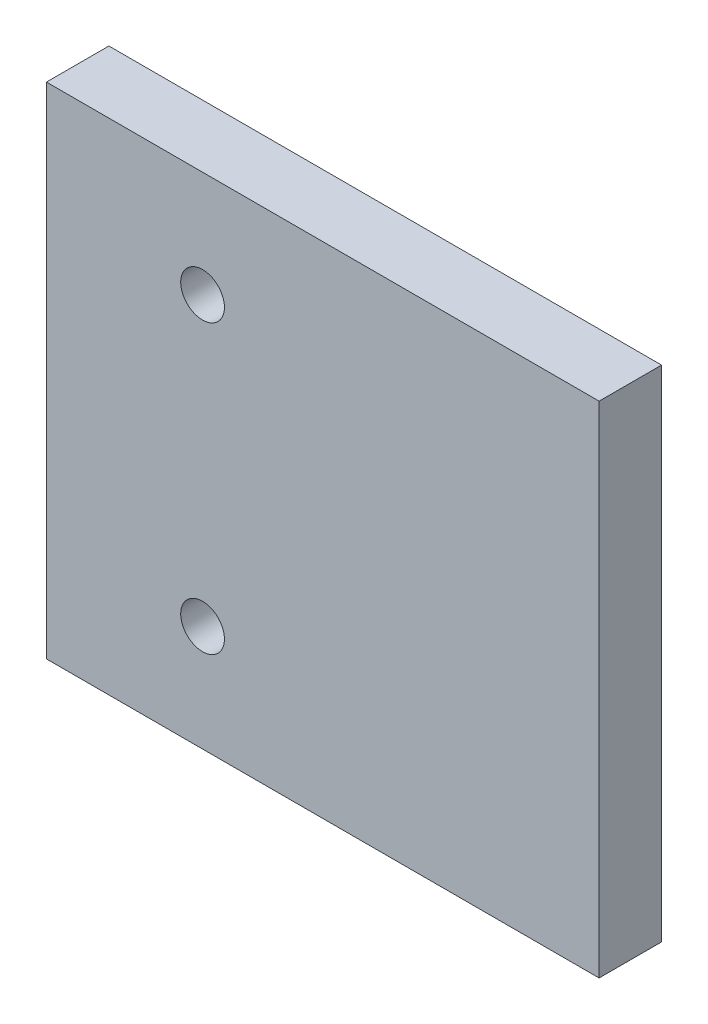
ISO-10303-21;
HEADER;
FILE_DESCRIPTION(('STEP AP214'),'2;1');
FILE_NAME('part.step','',(''),(''),'','','');
FILE_SCHEMA(('AUTOMOTIVE_DESIGN { 1 0 10303 214 1 1 1 1 }'));
ENDSEC;
DATA;
#1=APPLICATION_CONTEXT('core data for automotive mechanical design processes');
#2=APPLICATION_PROTOCOL_DEFINITION('international standard','automotive_design',2000,#1);
#3=PRODUCT_CONTEXT('',#1,'mechanical');
#4=PRODUCT('Part','Part','',(#3));
#5=PRODUCT_RELATED_PRODUCT_CATEGORY('part','',(#4));
#6=PRODUCT_DEFINITION_FORMATION('','',#4);
#7=PRODUCT_DEFINITION_CONTEXT('part definition',#1,'design');
#8=PRODUCT_DEFINITION('design','',#6,#7);
#9=PRODUCT_DEFINITION_SHAPE('','',#8);
#10=(LENGTH_UNIT() NAMED_UNIT(*) SI_UNIT(.MILLI.,.METRE.));
#11=(NAMED_UNIT(*) PLANE_ANGLE_UNIT() SI_UNIT($,.RADIAN.));
#12=(NAMED_UNIT(*) SI_UNIT($,.STERADIAN.) SOLID_ANGLE_UNIT());
#13=UNCERTAINTY_MEASURE_WITH_UNIT(LENGTH_MEASURE(1.E-05),#10,'distance_accuracy_value','');
#14=(GEOMETRIC_REPRESENTATION_CONTEXT(3) GLOBAL_UNCERTAINTY_ASSIGNED_CONTEXT((#13)) GLOBAL_UNIT_ASSIGNED_CONTEXT((#10,
#11,#12)) REPRESENTATION_CONTEXT('',''));
#15=CARTESIAN_POINT('',(0.,0.,0.));
#16=DIRECTION('',(0.,0.,1.));
#17=DIRECTION('',(1.,0.,0.));
#18=AXIS2_PLACEMENT_3D('',#15,#16,#17);
#19=CARTESIAN_POINT('',(0.,80.,10.));
#20=DIRECTION('',(0.,0.,-1.));
#21=DIRECTION('',(-1.,0.,0.));
#22=AXIS2_PLACEMENT_3D('',#19,#20,#21);
#23=PLANE('',#22);
#24=CARTESIAN_POINT('',(25.,63.,10.));
#25=DIRECTION('',(0.,0.,1.));
#26=DIRECTION('',(1.,0.,0.));
#27=AXIS2_PLACEMENT_3D('',#24,#25,#26);
#28=CIRCLE('',#27,3.5);
#29=CARTESIAN_POINT('',(28.5,63.,10.));
#30=VERTEX_POINT('',#29);
#31=EDGE_CURVE('E91',#30,#30,#28,.T.);
#32=ORIENTED_EDGE('',*,*,#31,.F.);
#33=EDGE_LOOP('',(#32));
#34=FACE_BOUND('',#33,.T.);
#35=DIRECTION('',(0.,-1.,0.));
#36=VECTOR('',#35,1.);
#37=CARTESIAN_POINT('',(0.,0.,10.));
#38=LINE('',#37,#36);
#39=CARTESIAN_POINT('',(0.,80.,10.));
#40=VERTEX_POINT('',#39);
#41=CARTESIAN_POINT('',(0.,0.,10.));
#42=VERTEX_POINT('',#41);
#43=EDGE_CURVE('E101',#40,#42,#38,.T.);
#44=ORIENTED_EDGE('',*,*,#43,.T.);
#45=DIRECTION('',(1.,0.,0.));
#46=VECTOR('',#45,1.);
#47=CARTESIAN_POINT('',(0.,0.,10.));
#48=LINE('',#47,#46);
#49=CARTESIAN_POINT('',(88.5,0.,10.));
#50=VERTEX_POINT('',#49);
#51=EDGE_CURVE('E86',#42,#50,#48,.T.);
#52=ORIENTED_EDGE('',*,*,#51,.T.);
#53=DIRECTION('',(0.,1.,0.));
#54=VECTOR('',#53,1.);
#55=CARTESIAN_POINT('',(88.5,0.,10.));
#56=LINE('',#55,#54);
#57=CARTESIAN_POINT('',(88.5,80.,10.));
#58=VERTEX_POINT('',#57);
#59=EDGE_CURVE('E52',#50,#58,#56,.T.);
#60=ORIENTED_EDGE('',*,*,#59,.T.);
#61=DIRECTION('',(-1.,0.,0.));
#62=VECTOR('',#61,1.);
#63=CARTESIAN_POINT('',(0.,80.,10.));
#64=LINE('',#63,#62);
#65=EDGE_CURVE('E47',#58,#40,#64,.T.);
#66=ORIENTED_EDGE('',*,*,#65,.T.);
#67=EDGE_LOOP('',(#44,#52,#60,#66));
#68=FACE_BOUND('',#67,.T.);
#69=CARTESIAN_POINT('',(25.,17.,10.));
#70=DIRECTION('',(0.,0.,1.));
#71=DIRECTION('',(1.,0.,0.));
#72=AXIS2_PLACEMENT_3D('',#69,#70,#71);
#73=CIRCLE('',#72,3.5);
#74=CARTESIAN_POINT('',(28.5,17.,10.));
#75=VERTEX_POINT('',#74);
#76=EDGE_CURVE('E119',#75,#75,#73,.T.);
#77=ORIENTED_EDGE('',*,*,#76,.F.);
#78=EDGE_LOOP('',(#77));
#79=FACE_BOUND('',#78,.T.);
#80=ADVANCED_FACE('F32',(#34,#68,#79),#23,.F.);
#81=CARTESIAN_POINT('',(0.,80.,0.));
#82=DIRECTION('',(0.,0.,-1.));
#83=DIRECTION('',(-1.,0.,0.));
#84=AXIS2_PLACEMENT_3D('',#81,#82,#83);
#85=PLANE('',#84);
#86=CARTESIAN_POINT('',(25.,63.,0.));
#87=DIRECTION('',(0.,0.,1.));
#88=DIRECTION('',(1.,0.,0.));
#89=AXIS2_PLACEMENT_3D('',#86,#87,#88);
#90=CIRCLE('',#89,3.5);
#91=CARTESIAN_POINT('',(28.5,63.,0.));
#92=VERTEX_POINT('',#91);
#93=EDGE_CURVE('E94',#92,#92,#90,.T.);
#94=ORIENTED_EDGE('',*,*,#93,.T.);
#95=EDGE_LOOP('',(#94));
#96=FACE_BOUND('',#95,.T.);
#97=DIRECTION('',(0.,-1.,0.));
#98=VECTOR('',#97,1.);
#99=CARTESIAN_POINT('',(0.,0.,0.));
#100=LINE('',#99,#98);
#101=CARTESIAN_POINT('',(0.,80.,0.));
#102=VERTEX_POINT('',#101);
#103=CARTESIAN_POINT('',(0.,0.,0.));
#104=VERTEX_POINT('',#103);
#105=EDGE_CURVE('E78',#102,#104,#100,.T.);
#106=ORIENTED_EDGE('',*,*,#105,.F.);
#107=DIRECTION('',(-1.,0.,0.));
#108=VECTOR('',#107,1.);
#109=CARTESIAN_POINT('',(0.,80.,0.));
#110=LINE('',#109,#108);
#111=CARTESIAN_POINT('',(88.5,80.,0.));
#112=VERTEX_POINT('',#111);
#113=EDGE_CURVE('E99',#112,#102,#110,.T.);
#114=ORIENTED_EDGE('',*,*,#113,.F.);
#115=DIRECTION('',(0.,1.,0.));
#116=VECTOR('',#115,1.);
#117=CARTESIAN_POINT('',(88.5,0.,0.));
#118=LINE('',#117,#116);
#119=CARTESIAN_POINT('',(88.5,0.,0.));
#120=VERTEX_POINT('',#119);
#121=EDGE_CURVE('E79',#120,#112,#118,.T.);
#122=ORIENTED_EDGE('',*,*,#121,.F.);
#123=DIRECTION('',(1.,0.,0.));
#124=VECTOR('',#123,1.);
#125=CARTESIAN_POINT('',(0.,0.,0.));
#126=LINE('',#125,#124);
#127=EDGE_CURVE('E73',#104,#120,#126,.T.);
#128=ORIENTED_EDGE('',*,*,#127,.F.);
#129=EDGE_LOOP('',(#106,#114,#122,#128));
#130=FACE_BOUND('',#129,.T.);
#131=CARTESIAN_POINT('',(25.,17.,0.));
#132=DIRECTION('',(0.,0.,1.));
#133=DIRECTION('',(1.,0.,0.));
#134=AXIS2_PLACEMENT_3D('',#131,#132,#133);
#135=CIRCLE('',#134,3.5);
#136=CARTESIAN_POINT('',(28.5,17.,0.));
#137=VERTEX_POINT('',#136);
#138=EDGE_CURVE('E121',#137,#137,#135,.T.);
#139=ORIENTED_EDGE('',*,*,#138,.T.);
#140=EDGE_LOOP('',(#139));
#141=FACE_BOUND('',#140,.T.);
#142=ADVANCED_FACE('F74',(#96,#130,#141),#85,.T.);
#143=CARTESIAN_POINT('',(0.,0.,10.));
#144=DIRECTION('',(1.,0.,0.));
#145=DIRECTION('',(0.,0.,-1.));
#146=AXIS2_PLACEMENT_3D('',#143,#144,#145);
#147=PLANE('',#146);
#148=ORIENTED_EDGE('',*,*,#105,.T.);
#149=DIRECTION('',(0.,0.,-1.));
#150=VECTOR('',#149,1.);
#151=CARTESIAN_POINT('',(0.,0.,10.));
#152=LINE('',#151,#150);
#153=EDGE_CURVE('E11',#42,#104,#152,.T.);
#154=ORIENTED_EDGE('',*,*,#153,.F.);
#155=ORIENTED_EDGE('',*,*,#43,.F.);
#156=DIRECTION('',(0.,0.,-1.));
#157=VECTOR('',#156,1.);
#158=CARTESIAN_POINT('',(0.,80.,10.));
#159=LINE('',#158,#157);
#160=EDGE_CURVE('E90',#40,#102,#159,.T.);
#161=ORIENTED_EDGE('',*,*,#160,.T.);
#162=EDGE_LOOP('',(#148,#154,#155,#161));
#163=FACE_BOUND('',#162,.T.);
#164=ADVANCED_FACE('F34',(#163),#147,.F.);
#165=CARTESIAN_POINT('',(0.,0.,10.));
#166=DIRECTION('',(0.,1.,0.));
#167=DIRECTION('',(0.,0.,1.));
#168=AXIS2_PLACEMENT_3D('',#165,#166,#167);
#169=PLANE('',#168);
#170=ORIENTED_EDGE('',*,*,#127,.T.);
#171=DIRECTION('',(0.,0.,-1.));
#172=VECTOR('',#171,1.);
#173=CARTESIAN_POINT('',(88.5,0.,10.));
#174=LINE('',#173,#172);
#175=EDGE_CURVE('E40',#50,#120,#174,.T.);
#176=ORIENTED_EDGE('',*,*,#175,.F.);
#177=ORIENTED_EDGE('',*,*,#51,.F.);
#178=ORIENTED_EDGE('',*,*,#153,.T.);
#179=EDGE_LOOP('',(#170,#176,#177,#178));
#180=FACE_BOUND('',#179,.T.);
#181=ADVANCED_FACE('F85',(#180),#169,.F.);
#182=CARTESIAN_POINT('',(88.5,0.,10.));
#183=DIRECTION('',(-1.,0.,0.));
#184=DIRECTION('',(0.,0.,1.));
#185=AXIS2_PLACEMENT_3D('',#182,#183,#184);
#186=PLANE('',#185);
#187=ORIENTED_EDGE('',*,*,#121,.T.);
#188=DIRECTION('',(0.,0.,-1.));
#189=VECTOR('',#188,1.);
#190=CARTESIAN_POINT('',(88.5,80.,10.));
#191=LINE('',#190,#189);
#192=EDGE_CURVE('E107',#58,#112,#191,.T.);
#193=ORIENTED_EDGE('',*,*,#192,.F.);
#194=ORIENTED_EDGE('',*,*,#59,.F.);
#195=ORIENTED_EDGE('',*,*,#175,.T.);
#196=EDGE_LOOP('',(#187,#193,#194,#195));
#197=FACE_BOUND('',#196,.T.);
#198=ADVANCED_FACE('F110',(#197),#186,.F.);
#199=CARTESIAN_POINT('',(0.,80.,10.));
#200=DIRECTION('',(0.,-1.,0.));
#201=DIRECTION('',(0.,0.,-1.));
#202=AXIS2_PLACEMENT_3D('',#199,#200,#201);
#203=PLANE('',#202);
#204=ORIENTED_EDGE('',*,*,#113,.T.);
#205=ORIENTED_EDGE('',*,*,#160,.F.);
#206=ORIENTED_EDGE('',*,*,#65,.F.);
#207=ORIENTED_EDGE('',*,*,#192,.T.);
#208=EDGE_LOOP('',(#204,#205,#206,#207));
#209=FACE_BOUND('',#208,.T.);
#210=ADVANCED_FACE('F112',(#209),#203,.F.);
#211=CARTESIAN_POINT('',(25.,63.,10.));
#212=DIRECTION('',(0.,0.,-1.));
#213=DIRECTION('',(-1.,0.,0.));
#214=AXIS2_PLACEMENT_3D('',#211,#212,#213);
#215=CYLINDRICAL_SURFACE('',#214,3.5);
#216=ORIENTED_EDGE('',*,*,#31,.T.);
#217=EDGE_LOOP('',(#216));
#218=FACE_BOUND('',#217,.T.);
#219=ORIENTED_EDGE('',*,*,#93,.F.);
#220=EDGE_LOOP('',(#219));
#221=FACE_BOUND('',#220,.T.);
#222=ADVANCED_FACE('F130',(#218,#221),#215,.F.);
#223=CARTESIAN_POINT('',(25.,17.,10.));
#224=DIRECTION('',(0.,0.,-1.));
#225=DIRECTION('',(-1.,0.,0.));
#226=AXIS2_PLACEMENT_3D('',#223,#224,#225);
#227=CYLINDRICAL_SURFACE('',#226,3.5);
#228=ORIENTED_EDGE('',*,*,#76,.T.);
#229=EDGE_LOOP('',(#228));
#230=FACE_BOUND('',#229,.T.);
#231=ORIENTED_EDGE('',*,*,#138,.F.);
#232=EDGE_LOOP('',(#231));
#233=FACE_BOUND('',#232,.T.);
#234=ADVANCED_FACE('F128',(#230,#233),#227,.F.);
#235=CLOSED_SHELL('',(#80,#142,#164,#181,#198,#210,#222,#234));
#236=MANIFOLD_SOLID_BREP('B2',#235);
#237=ADVANCED_BREP_SHAPE_REPRESENTATION('',(#18,#236),#14);
#238=SHAPE_DEFINITION_REPRESENTATION(#9,#237);
ENDSEC;
END-ISO-10303-21;
